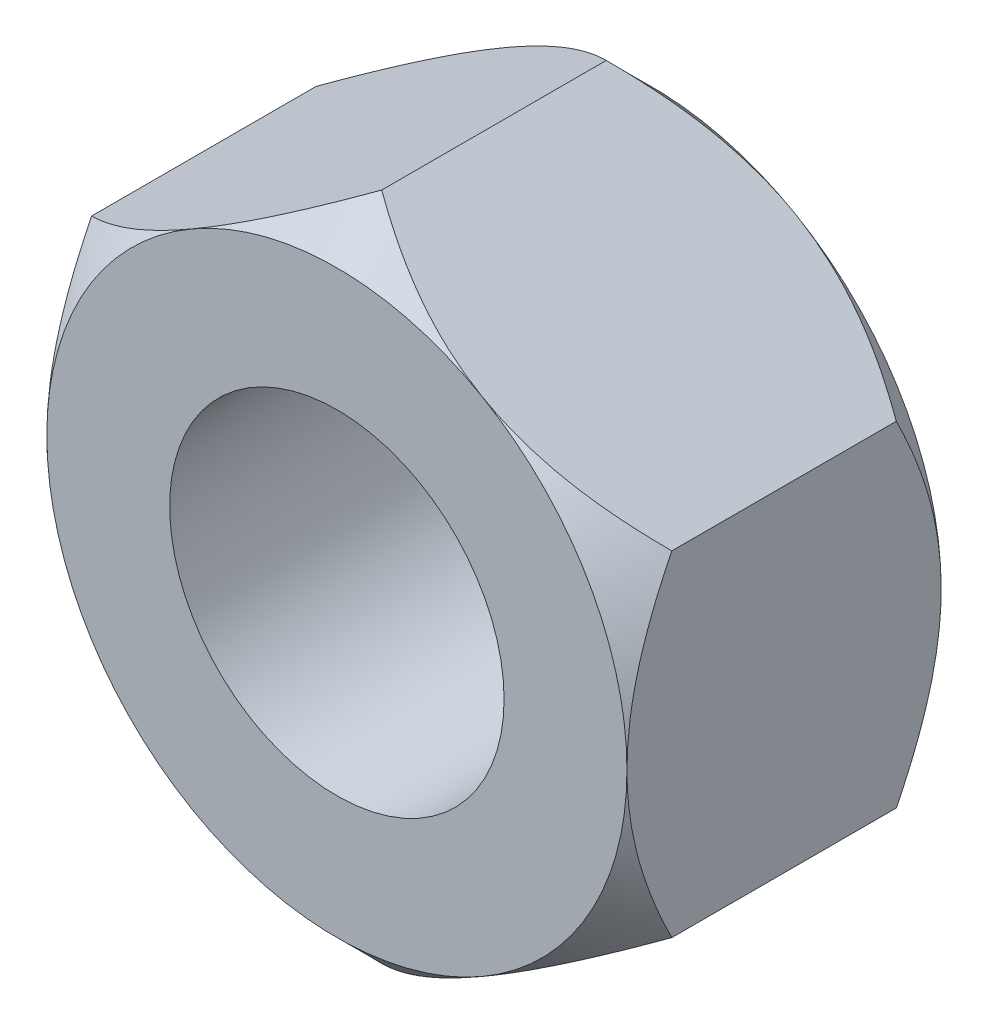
from build123d import *

# Parameters (mm, degrees)
BASE_EXTRUDE_DEPTH = 6.5
SKETCH4_R          = 6.9175
CUT_EXTRUDE1_DEPTH = 23.472205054


with BuildPart() as part:
    # Sketch1 → Base-Extrude (new, symmetric)
    with BuildSketch(Plane.XY):
        Polygon((12, 6.92820323), (12, -6.92820323), (0, -13.856406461), (-12, -6.92820323), (-12, 6.92820323), (0, 13.856406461), align=None)
    extrude(amount=BASE_EXTRUDE_DEPTH, both=True)

    # Sketch3 → Cut-Revolve1 (revolve, cut)
    with BuildSketch(Plane(origin=(0, 0, 0), x_dir=(1, 0, 0), z_dir=(0, 1, 0))):
        Polygon((-17, 6.5), (-12, 6.5), (-17, 1.5), align=None)
    cut_revolve1 = revolve(axis=Axis((0, 0, -6.5), (0, 0, 1)), mode=Mode.SUBTRACT)

    # Mirror1: Cut-Revolve1 across plane
    add(cut_revolve1.mirror(Plane.XY), mode=Mode.SUBTRACT)

    # Sketch4 → Cut-Extrude1 (cut, through all)
    with BuildSketch(Plane.XY.offset(6.5)):
        Circle(SKETCH4_R)
    extrude(amount=-CUT_EXTRUDE1_DEPTH, mode=Mode.SUBTRACT)


solid = part.part
